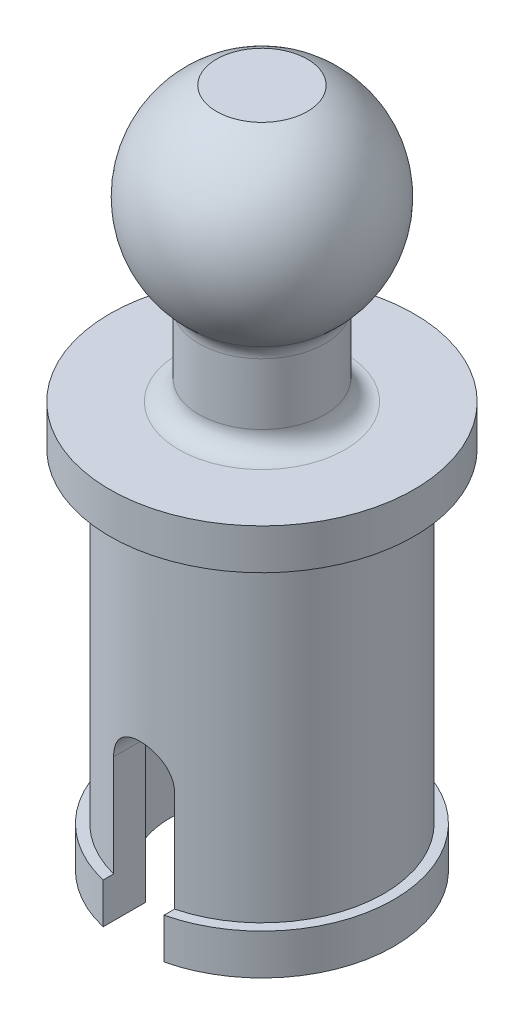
from build123d import *

# Parameters (mm, degrees)
CUT_EXTRUDE_1_DEPTH      = 15.055603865
CUT_EXTRUDE_1_DEPTH_BACK = 15.055603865
SKETCH_3_R               = 1.8
CUT_EXTRUDE_2_DEPTH      = 7.2
FILLET_1_R               = 0.4


with BuildPart() as part:
    # Sketch 1 → Revolve 1 (revolve)
    with BuildSketch(Plane.XY, mode=Mode.PRIVATE) as revolve_1_sk:
        with BuildLine():
            Line((1.24, 8), (3, 8))
            Line((3, 8), (3, 7.2))
            Line((3, 7.2), (2.4, 7.2))
            Line((2.4, 7.2), (2.4, 0.8))
            Line((2.4, 0.8), (2.6, 0.8))
            Line((2.6, 0.8), (2.6, 0))
            Line((2.6, 0), (0, 0))
            Line((0, 0), (0, 13.4))
            Line((0, 13.4), (0.894944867, 13.4))
            ThreePointArc((0.894944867, 13.4), (2.092724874, 11.69826906), (1.24, 9.8))
            Line((1.24, 9.8), (1.24, 8))
        make_face()
    revolve(revolve_1_sk.sketch.rotate(Axis((0, 16.880695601, 0), (0, -1, 0)), 180), axis=Axis((0, 16.880695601, 0), (0, -1, 0)))

    # Sketch 2 → Cut-Extrude 1 (cut, two sides: drawn at the far end of the back side and taken through both)
    with BuildSketch(Plane.XY.offset(-CUT_EXTRUDE_1_DEPTH_BACK)):
        with BuildLine():
            Line((-0.6, 0), (-0.6, 2.8))
            ThreePointArc((-0.6, 2.8), (0, 3.4), (0.6, 2.8))
            Line((0.6, 2.8), (0.6, 0))
            Line((0.6, 0), (-0.6, 0))
        make_face()
    extrude(amount=CUT_EXTRUDE_1_DEPTH + CUT_EXTRUDE_1_DEPTH_BACK, mode=Mode.SUBTRACT)

    # Sketch 3 → Cut-Extrude 2 (cut)
    with BuildSketch(Plane.XZ):
        with Locations(Location((0, 0, 0), (0, 0, 270))):
            Circle(SKETCH_3_R)
    extrude(amount=-CUT_EXTRUDE_2_DEPTH, mode=Mode.SUBTRACT)

    # Fillet 1
    fillet_1_edges = [part.edges().sort_by_distance(p)[0] for p in [
        (1.24, 9.8, 0),
        (1.24, 8, 0),
    ]]
    fillet(fillet_1_edges, radius=FILLET_1_R)


solid = part.part
